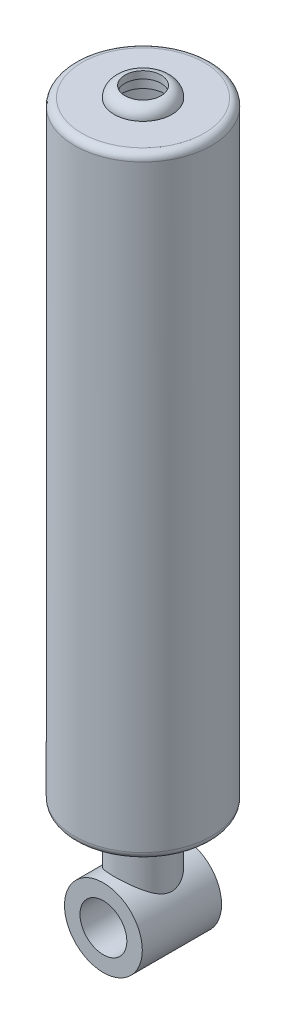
ISO-10303-21;
HEADER;
FILE_DESCRIPTION(('STEP AP214'),'2;1');
FILE_NAME('part.step','',(''),(''),'','','');
FILE_SCHEMA(('AUTOMOTIVE_DESIGN { 1 0 10303 214 1 1 1 1 }'));
ENDSEC;
DATA;
#1=APPLICATION_CONTEXT('core data for automotive mechanical design processes');
#2=APPLICATION_PROTOCOL_DEFINITION('international standard','automotive_design',2000,#1);
#3=PRODUCT_CONTEXT('',#1,'mechanical');
#4=PRODUCT('Part','Part','',(#3));
#5=PRODUCT_RELATED_PRODUCT_CATEGORY('part','',(#4));
#6=PRODUCT_DEFINITION_FORMATION('','',#4);
#7=PRODUCT_DEFINITION_CONTEXT('part definition',#1,'design');
#8=PRODUCT_DEFINITION('design','',#6,#7);
#9=PRODUCT_DEFINITION_SHAPE('','',#8);
#10=(LENGTH_UNIT() NAMED_UNIT(*) SI_UNIT(.MILLI.,.METRE.));
#11=(NAMED_UNIT(*) PLANE_ANGLE_UNIT() SI_UNIT($,.RADIAN.));
#12=(NAMED_UNIT(*) SI_UNIT($,.STERADIAN.) SOLID_ANGLE_UNIT());
#13=UNCERTAINTY_MEASURE_WITH_UNIT(LENGTH_MEASURE(1.E-05),#10,'distance_accuracy_value','');
#14=(GEOMETRIC_REPRESENTATION_CONTEXT(3) GLOBAL_UNCERTAINTY_ASSIGNED_CONTEXT((#13)) GLOBAL_UNIT_ASSIGNED_CONTEXT((#10,
#11,#12)) REPRESENTATION_CONTEXT('',''));
#15=CARTESIAN_POINT('',(0.,0.,0.));
#16=DIRECTION('',(0.,0.,1.));
#17=DIRECTION('',(1.,0.,0.));
#18=AXIS2_PLACEMENT_3D('',#15,#16,#17);
#19=CARTESIAN_POINT('',(0.,26.,5.));
#20=DIRECTION('',(0.,1.,0.));
#21=DIRECTION('',(0.,0.,1.));
#22=AXIS2_PLACEMENT_3D('',#19,#20,#21);
#23=PLANE('',#22);
#24=CARTESIAN_POINT('',(0.,26.0000000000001,11.));
#25=DIRECTION('',(0.,-1.,0.));
#26=DIRECTION('',(0.,0.,-1.));
#27=AXIS2_PLACEMENT_3D('',#24,#25,#26);
#28=CIRCLE('',#27,17.);
#29=CARTESIAN_POINT('',(0.,26.0000000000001,-6.00000000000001));
#30=VERTEX_POINT('',#29);
#31=EDGE_CURVE('E64',#30,#30,#28,.T.);
#32=ORIENTED_EDGE('',*,*,#31,.F.);
#33=EDGE_LOOP('',(#32));
#34=FACE_BOUND('',#33,.T.);
#35=CARTESIAN_POINT('',(0.,26.0000000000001,11.));
#36=DIRECTION('',(0.,1.,0.));
#37=DIRECTION('',(0.,0.,1.));
#38=AXIS2_PLACEMENT_3D('',#35,#36,#37);
#39=CIRCLE('',#38,8.);
#40=CARTESIAN_POINT('',(0.,26.0000000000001,19.));
#41=VERTEX_POINT('',#40);
#42=EDGE_CURVE('E61',#41,#41,#39,.T.);
#43=ORIENTED_EDGE('',*,*,#42,.F.);
#44=EDGE_LOOP('',(#43));
#45=FACE_BOUND('',#44,.T.);
#46=ADVANCED_FACE('F27',(#34,#45),#23,.T.);
#47=CARTESIAN_POINT('',(0.,0.,11.));
#48=DIRECTION('',(0.,-1.,0.));
#49=DIRECTION('',(0.,0.,-1.));
#50=AXIS2_PLACEMENT_3D('',#47,#48,#49);
#51=CYLINDRICAL_SURFACE('',#50,17.);
#52=ORIENTED_EDGE('',*,*,#31,.T.);
#53=EDGE_LOOP('',(#52));
#54=FACE_BOUND('',#53,.T.);
#55=CARTESIAN_POINT('',(1.76941794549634E-13,192.000000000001,11.));
#56=DIRECTION('',(0.,-1.,0.));
#57=DIRECTION('',(0.,0.,-1.));
#58=AXIS2_PLACEMENT_3D('',#55,#56,#57);
#59=CIRCLE('',#58,17.);
#60=CARTESIAN_POINT('',(1.82579981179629E-13,192.000000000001,-6.00000000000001));
#61=VERTEX_POINT('',#60);
#62=EDGE_CURVE('E177',#61,#61,#59,.T.);
#63=ORIENTED_EDGE('',*,*,#62,.F.);
#64=EDGE_LOOP('',(#63));
#65=FACE_BOUND('',#64,.T.);
#66=ADVANCED_FACE('F96',(#54,#65),#51,.F.);
#67=CARTESIAN_POINT('',(0.,192.,5.));
#68=DIRECTION('',(0.,-1.,0.));
#69=DIRECTION('',(0.,0.,-1.));
#70=AXIS2_PLACEMENT_3D('',#67,#68,#69);
#71=PLANE('',#70);
#72=ORIENTED_EDGE('',*,*,#62,.T.);
#73=EDGE_LOOP('',(#72));
#74=FACE_BOUND('',#73,.T.);
#75=CARTESIAN_POINT('',(1.76941794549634E-13,192.000000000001,11.));
#76=DIRECTION('',(0.,-1.,0.));
#77=DIRECTION('',(0.,0.,-1.));
#78=AXIS2_PLACEMENT_3D('',#75,#76,#77);
#79=CIRCLE('',#78,6.);
#80=CARTESIAN_POINT('',(1.78931742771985E-13,192.000000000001,5.));
#81=VERTEX_POINT('',#80);
#82=EDGE_CURVE('E180',#81,#81,#79,.T.);
#83=ORIENTED_EDGE('',*,*,#82,.F.);
#84=EDGE_LOOP('',(#83));
#85=FACE_BOUND('',#84,.T.);
#86=ADVANCED_FACE('F102',(#74,#85),#71,.T.);
#87=CARTESIAN_POINT('',(0.,0.,11.));
#88=DIRECTION('',(0.,-1.,0.));
#89=DIRECTION('',(0.,0.,-1.));
#90=AXIS2_PLACEMENT_3D('',#87,#88,#89);
#91=CYLINDRICAL_SURFACE('',#90,6.);
#92=ORIENTED_EDGE('',*,*,#82,.T.);
#93=EDGE_LOOP('',(#92));
#94=FACE_BOUND('',#93,.T.);
#95=CARTESIAN_POINT('',(1.87350135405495E-13,195.000000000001,11.));
#96=DIRECTION('',(0.,-1.,0.));
#97=DIRECTION('',(0.,0.,-1.));
#98=AXIS2_PLACEMENT_3D('',#95,#96,#97);
#99=CIRCLE('',#98,6.);
#100=CARTESIAN_POINT('',(1.89340083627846E-13,195.000000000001,5.));
#101=VERTEX_POINT('',#100);
#102=EDGE_CURVE('E181',#101,#101,#99,.T.);
#103=ORIENTED_EDGE('',*,*,#102,.F.);
#104=EDGE_LOOP('',(#103));
#105=FACE_BOUND('',#104,.T.);
#106=ADVANCED_FACE('F166',(#94,#105),#91,.F.);
#107=CARTESIAN_POINT('',(1.87350135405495E-13,195.000000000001,11.));
#108=DIRECTION('',(0.,-1.,0.));
#109=DIRECTION('',(0.,0.,-1.));
#110=AXIS2_PLACEMENT_3D('',#107,#108,#109);
#111=PLANE('',#110);
#112=CARTESIAN_POINT('',(1.87350135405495E-13,195.000000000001,11.));
#113=DIRECTION('',(0.,-1.,0.));
#114=DIRECTION('',(0.,0.,-1.));
#115=AXIS2_PLACEMENT_3D('',#112,#113,#114);
#116=CIRCLE('',#115,5.);
#117=CARTESIAN_POINT('',(1.89008425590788E-13,195.000000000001,5.99999999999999));
#118=VERTEX_POINT('',#117);
#119=EDGE_CURVE('E52',#118,#118,#116,.T.);
#120=ORIENTED_EDGE('',*,*,#119,.F.);
#121=EDGE_LOOP('',(#120));
#122=FACE_BOUND('',#121,.T.);
#123=ORIENTED_EDGE('',*,*,#102,.T.);
#124=EDGE_LOOP('',(#123));
#125=FACE_BOUND('',#124,.T.);
#126=ADVANCED_FACE('F163',(#122,#125),#111,.T.);
#127=CARTESIAN_POINT('',(0.,30.0000000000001,10.9999999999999));
#128=DIRECTION('',(0.,1.,0.));
#129=DIRECTION('',(0.,0.,1.));
#130=AXIS2_PLACEMENT_3D('',#127,#128,#129);
#131=PLANE('',#130);
#132=CARTESIAN_POINT('',(0.,30.0000000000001,10.9999999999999));
#133=DIRECTION('',(0.,1.,0.));
#134=DIRECTION('',(0.,0.,1.));
#135=AXIS2_PLACEMENT_3D('',#132,#133,#134);
#136=CIRCLE('',#135,5.);
#137=CARTESIAN_POINT('',(0.,30.0000000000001,15.9999999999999));
#138=VERTEX_POINT('',#137);
#139=EDGE_CURVE('E196',#138,#138,#136,.T.);
#140=ORIENTED_EDGE('',*,*,#139,.F.);
#141=EDGE_LOOP('',(#140));
#142=FACE_BOUND('',#141,.T.);
#143=CARTESIAN_POINT('',(0.,30.0000000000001,10.9999999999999));
#144=DIRECTION('',(0.,1.,0.));
#145=DIRECTION('',(0.,0.,1.));
#146=AXIS2_PLACEMENT_3D('',#143,#144,#145);
#147=CIRCLE('',#146,8.);
#148=CARTESIAN_POINT('',(0.,30.0000000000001,18.9999999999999));
#149=VERTEX_POINT('',#148);
#150=EDGE_CURVE('E123',#149,#149,#147,.T.);
#151=ORIENTED_EDGE('',*,*,#150,.T.);
#152=EDGE_LOOP('',(#151));
#153=FACE_BOUND('',#152,.T.);
#154=ADVANCED_FACE('F78',(#142,#153),#131,.T.);
#155=CARTESIAN_POINT('',(0.,30.0000000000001,10.9999999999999));
#156=DIRECTION('',(0.,-1.,0.));
#157=DIRECTION('',(0.,0.,-1.));
#158=AXIS2_PLACEMENT_3D('',#155,#156,#157);
#159=CYLINDRICAL_SURFACE('',#158,8.);
#160=ORIENTED_EDGE('',*,*,#42,.T.);
#161=EDGE_LOOP('',(#160));
#162=FACE_BOUND('',#161,.T.);
#163=ORIENTED_EDGE('',*,*,#150,.F.);
#164=EDGE_LOOP('',(#163));
#165=FACE_BOUND('',#164,.T.);
#166=ADVANCED_FACE('F72',(#162,#165),#159,.T.);
#167=CARTESIAN_POINT('',(1.6826817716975E-13,167.,11.));
#168=DIRECTION('',(0.,1.,0.));
#169=DIRECTION('',(0.,0.,1.));
#170=AXIS2_PLACEMENT_3D('',#167,#168,#169);
#171=CYLINDRICAL_SURFACE('',#170,5.);
#172=ORIENTED_EDGE('',*,*,#119,.T.);
#173=EDGE_LOOP('',(#172));
#174=FACE_BOUND('',#173,.T.);
#175=CARTESIAN_POINT('',(1.31838984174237E-13,197.000000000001,10.9999999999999));
#176=DIRECTION('',(0.,1.,0.));
#177=DIRECTION('',(0.,0.,1.));
#178=AXIS2_PLACEMENT_3D('',#175,#176,#177);
#179=CIRCLE('',#178,5.);
#180=CARTESIAN_POINT('',(1.30180693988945E-13,197.000000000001,15.9999999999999));
#181=VERTEX_POINT('',#180);
#182=EDGE_CURVE('E56',#181,#181,#179,.T.);
#183=ORIENTED_EDGE('',*,*,#182,.T.);
#184=EDGE_LOOP('',(#183));
#185=FACE_BOUND('',#184,.T.);
#186=ADVANCED_FACE('F77',(#174,#185),#171,.F.);
#187=CARTESIAN_POINT('',(0.,21.0000000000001,11.));
#188=DIRECTION('',(0.,-1.,0.));
#189=DIRECTION('',(0.,0.,-1.));
#190=AXIS2_PLACEMENT_3D('',#187,#188,#189);
#191=CIRCLE('',#190,8.);
#192=CARTESIAN_POINT('',(0.,21.0000000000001,3.00000000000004));
#193=VERTEX_POINT('',#192);
#194=EDGE_CURVE('E57',#193,#193,#191,.T.);
#195=ORIENTED_EDGE('',*,*,#194,.T.);
#196=EDGE_LOOP('',(#195));
#197=FACE_BOUND('',#196,.T.);
#198=CARTESIAN_POINT('',(0.,10.8,2.99999999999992));
#199=CARTESIAN_POINT('',(-0.196279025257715,10.8000009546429,2.99999899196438));
#200=CARTESIAN_POINT('',(-0.392546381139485,10.794638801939,3.00723327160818));
#201=CARTESIAN_POINT('',(-0.783431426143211,10.7733253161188,3.03604161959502));
#202=CARTESIAN_POINT('',(-0.978049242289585,10.7573748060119,3.05761457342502));
#203=CARTESIAN_POINT('',(-1.36414109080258,10.715262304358,3.11474680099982));
#204=CARTESIAN_POINT('',(-1.55561427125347,10.6890975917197,3.15030980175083));
#205=CARTESIAN_POINT('',(-1.93397723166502,10.6271579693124,3.23486547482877));
#206=CARTESIAN_POINT('',(-2.12086685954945,10.5913827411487,3.28385859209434));
#207=CARTESIAN_POINT('',(-2.48786322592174,10.5112144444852,3.39427441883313));
#208=CARTESIAN_POINT('',(-2.66800135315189,10.4668693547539,3.45562800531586));
#209=CARTESIAN_POINT('',(-3.02167978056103,10.3702976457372,3.5901910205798));
#210=CARTESIAN_POINT('',(-3.19521744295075,10.3180679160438,3.66340512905));
#211=CARTESIAN_POINT('',(-3.53481579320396,10.2067135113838,3.82085676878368));
#212=CARTESIAN_POINT('',(-3.70087928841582,10.1475914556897,3.90509011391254));
#213=CARTESIAN_POINT('',(-4.0251062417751,10.0234062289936,4.08387325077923));
#214=CARTESIAN_POINT('',(-4.1832667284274,9.95834084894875,4.17842688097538));
#215=CARTESIAN_POINT('',(-4.50532077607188,9.8171157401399,4.38621944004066));
#216=CARTESIAN_POINT('',(-4.6684153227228,9.7404856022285,4.50037641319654));
#217=CARTESIAN_POINT('',(-4.98429836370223,9.58269008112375,4.73932897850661));
#218=CARTESIAN_POINT('',(-5.13708554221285,9.50152412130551,4.86412592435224));
#219=CARTESIAN_POINT('',(-5.43230730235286,9.33588374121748,5.12388277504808));
#220=CARTESIAN_POINT('',(-5.57472613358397,9.25140457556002,5.2588575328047));
#221=CARTESIAN_POINT('',(-5.84871747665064,9.080669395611,5.53824390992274));
#222=CARTESIAN_POINT('',(-5.9802929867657,8.99441388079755,5.68265290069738));
#223=CARTESIAN_POINT('',(-6.25750885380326,8.80438161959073,6.01017916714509));
#224=CARTESIAN_POINT('',(-6.4007528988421,8.70052724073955,6.1952881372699));
#225=CARTESIAN_POINT('',(-6.67105068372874,8.49505216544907,6.5782308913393));
#226=CARTESIAN_POINT('',(-6.79809965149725,8.39343213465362,6.7760684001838));
#227=CARTESIAN_POINT('',(-7.03519833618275,8.19571693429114,7.1840393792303));
#228=CARTESIAN_POINT('',(-7.14526592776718,8.09961602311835,7.39415959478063));
#229=CARTESIAN_POINT('',(-7.34750160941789,7.91661602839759,7.82648283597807));
#230=CARTESIAN_POINT('',(-7.43967980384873,7.82971176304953,8.04867894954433));
#231=CARTESIAN_POINT('',(-7.63159301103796,7.64343078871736,8.5789146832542));
#232=CARTESIAN_POINT('',(-7.72415166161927,7.54909241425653,8.8914998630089));
#233=CARTESIAN_POINT('',(-7.83448398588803,7.4339545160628,9.37274146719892));
#234=CARTESIAN_POINT('',(-7.86650046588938,7.39998188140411,9.53512107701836));
#235=CARTESIAN_POINT('',(-7.92057039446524,7.3420801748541,9.86326525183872));
#236=CARTESIAN_POINT('',(-7.94262890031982,7.31814600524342,10.0290280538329));
#237=CARTESIAN_POINT('',(-7.97649745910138,7.28121754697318,10.3642927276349));
#238=CARTESIAN_POINT('',(-7.98821672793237,7.26832019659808,10.5338145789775));
#239=CARTESIAN_POINT('',(-8.0008113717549,7.25445434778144,10.8737494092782));
#240=CARTESIAN_POINT('',(-8.00168722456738,7.25348532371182,11.0441623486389));
#241=CARTESIAN_POINT('',(-7.99257147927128,7.26352843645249,11.3844266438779));
#242=CARTESIAN_POINT('',(-7.98257420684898,7.2745468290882,11.5542776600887));
#243=CARTESIAN_POINT('',(-7.95193692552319,7.30802341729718,11.891874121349));
#244=CARTESIAN_POINT('',(-7.93129575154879,7.33048286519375,12.05961933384));
#245=CARTESIAN_POINT('',(-7.87723784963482,7.38856190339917,12.4082834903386));
#246=CARTESIAN_POINT('',(-7.84275537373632,7.42526750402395,12.5888549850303));
#247=CARTESIAN_POINT('',(-7.7621391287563,7.50949957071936,12.9448778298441));
#248=CARTESIAN_POINT('',(-7.71599758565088,7.55703325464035,13.1203256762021));
#249=CARTESIAN_POINT('',(-7.61271497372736,7.66106686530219,13.4655844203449));
#250=CARTESIAN_POINT('',(-7.55555288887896,7.71758388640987,13.6353838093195));
#251=CARTESIAN_POINT('',(-7.43097899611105,7.83760373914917,13.9685310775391));
#252=CARTESIAN_POINT('',(-7.36356988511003,7.90110473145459,14.1318806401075));
#253=CARTESIAN_POINT('',(-7.19258768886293,8.05757775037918,14.5105896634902));
#254=CARTESIAN_POINT('',(-7.08480640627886,8.15283246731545,14.723113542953));
#255=CARTESIAN_POINT('',(-6.85215960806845,8.34931825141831,15.1357017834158));
#256=CARTESIAN_POINT('',(-6.72728825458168,8.4505513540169,15.3357618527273));
#257=CARTESIAN_POINT('',(-6.46103924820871,8.6558222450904,15.7233781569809));
#258=CARTESIAN_POINT('',(-6.31964553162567,8.75986268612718,15.9109219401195));
#259=CARTESIAN_POINT('',(-6.02092998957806,8.96780483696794,16.2728983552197));
#260=CARTESIAN_POINT('',(-5.86361006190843,9.07170656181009,16.4473325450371));
#261=CARTESIAN_POINT('',(-5.53068847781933,9.27849700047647,16.7852083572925));
#262=CARTESIAN_POINT('',(-5.354831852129,9.38134200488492,16.9484260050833));
#263=CARTESIAN_POINT('',(-4.98734856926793,9.58176175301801,17.2597394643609));
#264=CARTESIAN_POINT('',(-4.79572018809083,9.67933591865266,17.4078336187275));
#265=CARTESIAN_POINT('',(-4.39761924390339,9.86657184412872,17.6872994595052));
#266=CARTESIAN_POINT('',(-4.19117612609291,9.95624855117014,17.8187029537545));
#267=CARTESIAN_POINT('',(-3.76397643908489,10.125473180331,18.0634995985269));
#268=CARTESIAN_POINT('',(-3.54322523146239,10.2050248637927,18.1768994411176));
#269=CARTESIAN_POINT('',(-3.14668728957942,10.3329584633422,18.3575119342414));
#270=CARTESIAN_POINT('',(-2.973788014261,10.3841159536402,18.4291286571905));
#271=CARTESIAN_POINT('',(-2.62151761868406,10.4785913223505,18.560619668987));
#272=CARTESIAN_POINT('',(-2.44214795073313,10.5219109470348,18.6204965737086));
#273=CARTESIAN_POINT('',(-2.07795643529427,10.5998469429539,18.7277494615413));
#274=CARTESIAN_POINT('',(-1.89313744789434,10.6344677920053,18.77513187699));
#275=CARTESIAN_POINT('',(-1.51911019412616,10.6943054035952,18.8567767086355));
#276=CARTESIAN_POINT('',(-1.32990182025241,10.719521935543,18.8910388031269));
#277=CARTESIAN_POINT('',(-0.947638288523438,10.7600686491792,18.9460320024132));
#278=CARTESIAN_POINT('',(-0.754570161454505,10.7753561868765,18.9667047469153));
#279=CARTESIAN_POINT('',(-0.366895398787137,10.7955110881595,18.9939442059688));
#280=CARTESIAN_POINT('',(-0.17228876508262,10.8003784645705,19.0005109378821));
#281=CARTESIAN_POINT('',(0.21685808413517,10.7995755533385,18.9994269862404));
#282=CARTESIAN_POINT('',(0.411398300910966,10.7939054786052,18.9917765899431));
#283=CARTESIAN_POINT('',(0.79881691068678,10.7721646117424,18.9623883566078));
#284=CARTESIAN_POINT('',(0.991695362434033,10.7560941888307,18.9406510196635));
#285=CARTESIAN_POINT('',(1.36157595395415,10.7153350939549,18.8853490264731));
#286=CARTESIAN_POINT('',(1.53878223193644,10.6912891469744,18.8526650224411));
#287=CARTESIAN_POINT('',(1.88939034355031,10.6349302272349,18.7757588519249));
#288=CARTESIAN_POINT('',(2.06279086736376,10.6026144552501,18.7315327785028));
#289=CARTESIAN_POINT('',(2.40472053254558,10.5303300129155,18.6321042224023));
#290=CARTESIAN_POINT('',(2.57325087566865,10.4903632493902,18.5769044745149));
#291=CARTESIAN_POINT('',(2.90474789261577,10.4034523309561,18.4561101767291));
#292=CARTESIAN_POINT('',(3.06771248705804,10.3565056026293,18.390511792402));
#293=CARTESIAN_POINT('',(3.39922868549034,10.2526870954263,18.2443383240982));
#294=CARTESIAN_POINT('',(3.56730081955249,10.1953378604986,18.1630140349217));
#295=CARTESIAN_POINT('',(3.89565891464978,10.0744483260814,17.98987372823));
#296=CARTESIAN_POINT('',(4.05594161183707,10.0109054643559,17.8980533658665));
#297=CARTESIAN_POINT('',(4.52445302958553,9.81244800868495,17.6078881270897));
#298=CARTESIAN_POINT('',(4.82046077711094,9.66966720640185,17.3947874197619));
#299=CARTESIAN_POINT('',(5.26331424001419,9.43252746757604,17.0285391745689));
#300=CARTESIAN_POINT('',(5.4217480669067,9.34217685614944,16.8863986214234));
#301=CARTESIAN_POINT('',(5.7260550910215,9.15880919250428,16.5908172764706));
#302=CARTESIAN_POINT('',(5.8719302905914,9.0657925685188,16.4373782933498));
#303=CARTESIAN_POINT('',(6.15100545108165,8.87881710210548,16.1195633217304));
#304=CARTESIAN_POINT('',(6.28419038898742,8.78485728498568,15.9551747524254));
#305=CARTESIAN_POINT('',(6.53740799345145,8.59808305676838,15.61595971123));
#306=CARTESIAN_POINT('',(6.65744194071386,8.5052685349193,15.4411342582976));
#307=CARTESIAN_POINT('',(6.87546293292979,8.32983180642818,15.094715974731));
#308=CARTESIAN_POINT('',(6.97442787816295,8.24696686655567,14.9238616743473));
#309=CARTESIAN_POINT('',(7.16029008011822,8.08612066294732,14.5734543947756));
#310=CARTESIAN_POINT('',(7.24718646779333,8.00813975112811,14.3939007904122));
#311=CARTESIAN_POINT('',(7.40811233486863,7.85950711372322,14.0265522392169));
#312=CARTESIAN_POINT('',(7.4821621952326,7.78884385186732,13.8387709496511));
#313=CARTESIAN_POINT('',(7.61667881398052,7.65735309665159,13.4550934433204));
#314=CARTESIAN_POINT('',(7.67715161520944,7.59652123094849,13.2592008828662));
#315=CARTESIAN_POINT('',(7.77029884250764,7.5010490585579,12.9095996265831));
#316=CARTESIAN_POINT('',(7.8061476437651,7.46365519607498,12.7574850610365));
#317=CARTESIAN_POINT('',(7.86911238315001,7.39724057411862,12.4497291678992));
#318=CARTESIAN_POINT('',(7.89623351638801,7.36821483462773,12.294089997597));
#319=CARTESIAN_POINT('',(7.94130243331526,7.31961873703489,11.9802132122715));
#320=CARTESIAN_POINT('',(7.95926146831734,7.30003678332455,11.821979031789));
#321=CARTESIAN_POINT('',(7.98571776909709,7.27108661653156,11.5037800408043));
#322=CARTESIAN_POINT('',(7.99421505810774,7.26171837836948,11.3438152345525));
#323=CARTESIAN_POINT('',(8.00158265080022,7.25359958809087,11.0228670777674));
#324=CARTESIAN_POINT('',(8.00042141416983,7.25488382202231,10.8618821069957));
#325=CARTESIAN_POINT('',(7.98842208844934,7.26809395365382,10.5407206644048));
#326=CARTESIAN_POINT('',(7.97758408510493,7.28001975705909,10.3805441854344));
#327=CARTESIAN_POINT('',(7.94643942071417,7.31400214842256,10.0620620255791));
#328=CARTESIAN_POINT('',(7.92612397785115,7.33606813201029,9.90375821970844));
#329=CARTESIAN_POINT('',(7.87638382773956,7.38944534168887,9.59009990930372));
#330=CARTESIAN_POINT('',(7.84695365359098,7.42076211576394,9.43474723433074));
#331=CARTESIAN_POINT('',(7.77054501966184,7.50082964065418,9.08740226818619));
#332=CARTESIAN_POINT('',(7.72098636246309,7.55199967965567,8.89653368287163));
#333=CARTESIAN_POINT('',(7.60899092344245,7.66482641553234,8.52178579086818));
#334=CARTESIAN_POINT('',(7.54654858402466,7.72648763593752,8.33790954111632));
#335=CARTESIAN_POINT('',(7.40951161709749,7.85800026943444,7.97735093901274));
#336=CARTESIAN_POINT('',(7.33489343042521,7.92786748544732,7.80068338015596));
#337=CARTESIAN_POINT('',(7.17428651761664,8.07349799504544,7.45515638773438));
#338=CARTESIAN_POINT('',(7.08829733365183,8.14926152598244,7.28629726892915));
#339=CARTESIAN_POINT('',(6.87798699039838,8.32812269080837,6.90690326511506));
#340=CARTESIAN_POINT('',(6.7499111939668,8.4325937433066,6.69908959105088));
#341=CARTESIAN_POINT('',(6.47618672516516,8.64459378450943,6.29700382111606));
#342=CARTESIAN_POINT('',(6.33053345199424,8.75212356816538,6.10273529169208));
#343=CARTESIAN_POINT('',(6.02209663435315,8.96714644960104,5.72806956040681));
#344=CARTESIAN_POINT('',(5.85930401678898,9.07463949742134,5.54767979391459));
#345=CARTESIAN_POINT('',(5.51704883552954,9.28669476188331,5.20160486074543));
#346=CARTESIAN_POINT('',(5.33758790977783,9.39125726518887,5.03591825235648));
#347=CARTESIAN_POINT('',(4.96159639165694,9.59523276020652,4.71962162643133));
#348=CARTESIAN_POINT('',(4.76499864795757,9.69462281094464,4.5690764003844));
#349=CARTESIAN_POINT('',(4.35591389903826,9.88518705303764,4.28524163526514));
#350=CARTESIAN_POINT('',(4.14342568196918,9.97636061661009,4.15195341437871));
#351=CARTESIAN_POINT('',(3.70390052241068,10.147741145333,3.90460828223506));
#352=CARTESIAN_POINT('',(3.47689181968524,10.2279685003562,3.79051551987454));
#353=CARTESIAN_POINT('',(3.00942760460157,10.375129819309,3.58321836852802));
#354=CARTESIAN_POINT('',(2.76897671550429,10.4420683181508,3.49000685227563));
#355=CARTESIAN_POINT('',(2.32308709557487,10.5491951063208,3.34182719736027));
#356=CARTESIAN_POINT('',(2.1195760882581,10.5920468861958,3.28296311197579));
#357=CARTESIAN_POINT('',(1.70657705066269,10.6663762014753,3.1812539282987));
#358=CARTESIAN_POINT('',(1.49709049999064,10.6978565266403,3.13840490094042));
#359=CARTESIAN_POINT('',(1.07408292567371,10.74856665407,3.06953800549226));
#360=CARTESIAN_POINT('',(0.860565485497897,10.7678068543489,3.04350585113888));
#361=CARTESIAN_POINT('',(0.431360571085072,10.7935225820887,3.00873797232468));
#362=CARTESIAN_POINT('',(0.215673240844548,10.7999989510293,3.00000110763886));
#363=CARTESIAN_POINT('',(0.,10.8,2.99999999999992));
#364=B_SPLINE_CURVE_WITH_KNOTS('',3,(#198,#199,#200,#201,#202,#203,#204,#205,#206,#207,#208,
#209,#210,#211,#212,#213,#214,#215,#216,#217,#218,#219,#220,#221,#222,#223,#224,#225,#226,#227,
#228,#229,#230,#231,#232,#233,#234,#235,#236,#237,#238,#239,#240,#241,#242,#243,#244,#245,#246,
#247,#248,#249,#250,#251,#252,#253,#254,#255,#256,#257,#258,#259,#260,#261,#262,#263,#264,#265,
#266,#267,#268,#269,#270,#271,#272,#273,#274,#275,#276,#277,#278,#279,#280,#281,#282,#283,#284,
#285,#286,#287,#288,#289,#290,#291,#292,#293,#294,#295,#296,#297,#298,#299,#300,#301,#302,#303,
#304,#305,#306,#307,#308,#309,#310,#311,#312,#313,#314,#315,#316,#317,#318,#319,#320,#321,#322,
#323,#324,#325,#326,#327,#328,#329,#330,#331,#332,#333,#334,#335,#336,#337,#338,#339,#340,#341,
#342,#343,#344,#345,#346,#347,#348,#349,#350,#351,#352,#353,#354,#355,#356,#357,#358,#359,#360,
#361,#362,#363),.UNSPECIFIED.,.T.,.F.,(4,2,2,2,2,2,2,2,2,2,2,2,2,2,2,2,2,2,2,2,2,2,2,2,2,2,2,2,
2,2,2,2,2,2,2,2,2,2,2,2,2,2,2,2,2,2,2,2,2,2,2,2,2,2,2,2,2,2,2,2,2,2,2,2,2,2,2,2,2,2,2,2,2,2,2,2,
2,2,2,2,2,2,4),(0.,0.588612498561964,1.17717925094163,1.76590290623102,2.35464606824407,
2.94018391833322,3.52595336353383,4.11150092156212,4.69726701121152,5.33661634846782,
5.97604714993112,6.61642986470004,7.25663490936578,8.02398458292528,8.79155984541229,
9.55832156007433,10.3246489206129,11.3385052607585,11.8448635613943,12.3509644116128,
12.8614660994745,13.3719452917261,13.8826910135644,14.3934926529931,14.9550562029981,
15.516995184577,16.0800165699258,16.6428900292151,17.4116880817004,18.1807494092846,
18.9505647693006,19.7202885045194,20.5024871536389,21.2847714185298,22.0655417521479,
22.8460211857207,23.4274893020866,24.0088277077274,24.589866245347,25.1709190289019,
25.7544511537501,26.3379825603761,26.9215021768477,27.505001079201,28.0497763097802,
28.5947361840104,29.1395604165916,29.6845860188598,30.2699586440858,30.8555744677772,
32.0264133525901,32.7196087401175,33.4126933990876,34.1065886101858,34.8004161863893,
35.4422796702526,36.0841893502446,36.7250711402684,37.3656671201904,37.8473073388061,
38.3286603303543,38.8094207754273,39.2901800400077,39.7725098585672,40.2548354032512,
40.7376087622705,41.2206722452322,41.8309348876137,42.4414613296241,43.0531834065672,
43.6649301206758,44.4604735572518,45.2562256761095,46.0524011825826,46.8484985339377,
47.6478691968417,48.4473008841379,49.2452224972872,50.0428713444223,50.690396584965,
51.3377628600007,51.9845784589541,52.6313514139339),.UNSPECIFIED.);
#365=CARTESIAN_POINT('',(0.,10.8,2.99999999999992));
#366=VERTEX_POINT('',#365);
#367=EDGE_CURVE('E51',#366,#366,#364,.T.);
#368=ORIENTED_EDGE('',*,*,#367,.T.);
#369=EDGE_LOOP('',(#368));
#370=FACE_BOUND('',#369,.T.);
#371=ADVANCED_FACE('F80',(#197,#370),#159,.T.);
#372=CARTESIAN_POINT('',(0.,0.,22.));
#373=DIRECTION('',(0.,0.,-1.));
#374=DIRECTION('',(-1.,0.,0.));
#375=AXIS2_PLACEMENT_3D('',#372,#373,#374);
#376=CYLINDRICAL_SURFACE('',#375,10.8);
#377=CARTESIAN_POINT('',(0.,0.,0.));
#378=DIRECTION('',(0.,0.,1.));
#379=DIRECTION('',(1.,0.,0.));
#380=AXIS2_PLACEMENT_3D('',#377,#378,#379);
#381=CIRCLE('',#380,10.8);
#382=CARTESIAN_POINT('',(10.8,0.,0.));
#383=VERTEX_POINT('',#382);
#384=EDGE_CURVE('E129',#383,#383,#381,.T.);
#385=ORIENTED_EDGE('',*,*,#384,.T.);
#386=EDGE_LOOP('',(#385));
#387=FACE_BOUND('',#386,.T.);
#388=CARTESIAN_POINT('',(0.,0.,22.));
#389=DIRECTION('',(0.,0.,1.));
#390=DIRECTION('',(1.,0.,0.));
#391=AXIS2_PLACEMENT_3D('',#388,#389,#390);
#392=CIRCLE('',#391,10.8);
#393=CARTESIAN_POINT('',(10.8,0.,22.));
#394=VERTEX_POINT('',#393);
#395=EDGE_CURVE('E70',#394,#394,#392,.T.);
#396=ORIENTED_EDGE('',*,*,#395,.F.);
#397=EDGE_LOOP('',(#396));
#398=FACE_BOUND('',#397,.T.);
#399=ORIENTED_EDGE('',*,*,#367,.F.);
#400=EDGE_LOOP('',(#399));
#401=FACE_BOUND('',#400,.T.);
#402=ADVANCED_FACE('F29',(#387,#398,#401),#376,.T.);
#403=CARTESIAN_POINT('',(0.,0.,22.));
#404=DIRECTION('',(0.,0.,1.));
#405=DIRECTION('',(1.,0.,0.));
#406=AXIS2_PLACEMENT_3D('',#403,#404,#405);
#407=PLANE('',#406);
#408=CARTESIAN_POINT('',(0.,0.,22.));
#409=DIRECTION('',(0.,0.,-1.));
#410=DIRECTION('',(-1.,0.,0.));
#411=AXIS2_PLACEMENT_3D('',#408,#409,#410);
#412=CIRCLE('',#411,6.5);
#413=CARTESIAN_POINT('',(-6.50000000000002,0.,22.));
#414=VERTEX_POINT('',#413);
#415=EDGE_CURVE('E119',#414,#414,#412,.T.);
#416=ORIENTED_EDGE('',*,*,#415,.T.);
#417=EDGE_LOOP('',(#416));
#418=FACE_BOUND('',#417,.T.);
#419=ORIENTED_EDGE('',*,*,#395,.T.);
#420=EDGE_LOOP('',(#419));
#421=FACE_BOUND('',#420,.T.);
#422=ADVANCED_FACE('F85',(#418,#421),#407,.T.);
#423=CARTESIAN_POINT('',(0.,0.,0.));
#424=DIRECTION('',(0.,0.,1.));
#425=DIRECTION('',(1.,0.,0.));
#426=AXIS2_PLACEMENT_3D('',#423,#424,#425);
#427=PLANE('',#426);
#428=CARTESIAN_POINT('',(0.,0.,0.));
#429=DIRECTION('',(0.,0.,-1.));
#430=DIRECTION('',(-1.,0.,0.));
#431=AXIS2_PLACEMENT_3D('',#428,#429,#430);
#432=CIRCLE('',#431,6.5);
#433=CARTESIAN_POINT('',(-6.50000000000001,0.,0.));
#434=VERTEX_POINT('',#433);
#435=EDGE_CURVE('E60',#434,#434,#432,.T.);
#436=ORIENTED_EDGE('',*,*,#435,.F.);
#437=EDGE_LOOP('',(#436));
#438=FACE_BOUND('',#437,.T.);
#439=ORIENTED_EDGE('',*,*,#384,.F.);
#440=EDGE_LOOP('',(#439));
#441=FACE_BOUND('',#440,.T.);
#442=ADVANCED_FACE('F82',(#438,#441),#427,.F.);
#443=CARTESIAN_POINT('',(0.,0.,22.));
#444=DIRECTION('',(0.,0.,-1.));
#445=DIRECTION('',(-1.,0.,0.));
#446=AXIS2_PLACEMENT_3D('',#443,#444,#445);
#447=CYLINDRICAL_SURFACE('',#446,6.5);
#448=ORIENTED_EDGE('',*,*,#415,.F.);
#449=EDGE_LOOP('',(#448));
#450=FACE_BOUND('',#449,.T.);
#451=ORIENTED_EDGE('',*,*,#435,.T.);
#452=EDGE_LOOP('',(#451));
#453=FACE_BOUND('',#452,.T.);
#454=ADVANCED_FACE('F84',(#450,#453),#447,.F.);
#455=CARTESIAN_POINT('',(0.,21.0000000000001,11.));
#456=DIRECTION('',(0.,-1.,0.));
#457=DIRECTION('',(0.,0.,-1.));
#458=AXIS2_PLACEMENT_3D('',#455,#456,#457);
#459=PLANE('',#458);
#460=CARTESIAN_POINT('',(0.,21.0000000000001,11.));
#461=DIRECTION('',(0.,-1.,0.));
#462=DIRECTION('',(0.,0.,-1.));
#463=AXIS2_PLACEMENT_3D('',#460,#461,#462);
#464=CIRCLE('',#463,10.);
#465=CARTESIAN_POINT('',(0.,21.0000000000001,1.00000000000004));
#466=VERTEX_POINT('',#465);
#467=EDGE_CURVE('E39',#466,#466,#464,.T.);
#468=ORIENTED_EDGE('',*,*,#467,.T.);
#469=EDGE_LOOP('',(#468));
#470=FACE_BOUND('',#469,.T.);
#471=ORIENTED_EDGE('',*,*,#194,.F.);
#472=EDGE_LOOP('',(#471));
#473=FACE_BOUND('',#472,.T.);
#474=ADVANCED_FACE('F109',(#470,#473),#459,.T.);
#475=CARTESIAN_POINT('',(0.,194.,2.99999999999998));
#476=DIRECTION('',(0.,1.,0.));
#477=DIRECTION('',(0.,0.,1.));
#478=AXIS2_PLACEMENT_3D('',#475,#476,#477);
#479=PLANE('',#478);
#480=CARTESIAN_POINT('',(1.83880688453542E-13,194.000000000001,11.));
#481=DIRECTION('',(0.,1.,0.));
#482=DIRECTION('',(0.,0.,1.));
#483=AXIS2_PLACEMENT_3D('',#480,#481,#482);
#484=CIRCLE('',#483,17.);
#485=CARTESIAN_POINT('',(1.78242501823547E-13,194.000000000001,28.));
#486=VERTEX_POINT('',#485);
#487=EDGE_CURVE('E10',#486,#486,#484,.T.);
#488=ORIENTED_EDGE('',*,*,#487,.T.);
#489=EDGE_LOOP('',(#488));
#490=FACE_BOUND('',#489,.T.);
#491=CARTESIAN_POINT('',(1.83880688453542E-13,194.000000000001,11.));
#492=DIRECTION('',(0.,-1.,0.));
#493=DIRECTION('',(0.,0.,-1.));
#494=AXIS2_PLACEMENT_3D('',#491,#492,#493);
#495=CIRCLE('',#494,8.);
#496=CARTESIAN_POINT('',(1.8653395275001E-13,194.000000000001,3.00000000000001));
#497=VERTEX_POINT('',#496);
#498=EDGE_CURVE('E184',#497,#497,#495,.T.);
#499=ORIENTED_EDGE('',*,*,#498,.T.);
#500=EDGE_LOOP('',(#499));
#501=FACE_BOUND('',#500,.T.);
#502=ADVANCED_FACE('F114',(#490,#501),#479,.T.);
#503=CARTESIAN_POINT('',(0.,0.,11.));
#504=DIRECTION('',(0.,-1.,0.));
#505=DIRECTION('',(0.,0.,-1.));
#506=AXIS2_PLACEMENT_3D('',#503,#504,#505);
#507=CYLINDRICAL_SURFACE('',#506,19.);
#508=CARTESIAN_POINT('',(1.76941794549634E-13,192.000000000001,11.));
#509=DIRECTION('',(0.,1.,0.));
#510=DIRECTION('',(0.,0.,1.));
#511=AXIS2_PLACEMENT_3D('',#508,#509,#510);
#512=CIRCLE('',#511,19.);
#513=CARTESIAN_POINT('',(1.70640291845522E-13,192.000000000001,30.));
#514=VERTEX_POINT('',#513);
#515=EDGE_CURVE('E35',#514,#514,#512,.F.);
#516=ORIENTED_EDGE('',*,*,#515,.T.);
#517=EDGE_LOOP('',(#516));
#518=FACE_BOUND('',#517,.T.);
#519=CARTESIAN_POINT('',(0.,26.0000000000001,11.));
#520=DIRECTION('',(0.,-1.,0.));
#521=DIRECTION('',(0.,0.,-1.));
#522=AXIS2_PLACEMENT_3D('',#519,#520,#521);
#523=CIRCLE('',#522,19.);
#524=CARTESIAN_POINT('',(0.,26.0000000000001,-8.));
#525=VERTEX_POINT('',#524);
#526=EDGE_CURVE('E43',#525,#525,#523,.F.);
#527=ORIENTED_EDGE('',*,*,#526,.T.);
#528=EDGE_LOOP('',(#527));
#529=FACE_BOUND('',#528,.T.);
#530=ADVANCED_FACE('F157',(#518,#529),#507,.T.);
#531=CARTESIAN_POINT('',(0.,24.,-2.));
#532=DIRECTION('',(0.,-1.,0.));
#533=DIRECTION('',(0.,0.,-1.));
#534=AXIS2_PLACEMENT_3D('',#531,#532,#533);
#535=PLANE('',#534);
#536=CARTESIAN_POINT('',(0.,24.0000000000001,11.));
#537=DIRECTION('',(0.,-1.,0.));
#538=DIRECTION('',(0.,0.,-1.));
#539=AXIS2_PLACEMENT_3D('',#536,#537,#538);
#540=CIRCLE('',#539,17.);
#541=CARTESIAN_POINT('',(0.,24.0000000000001,-6.));
#542=VERTEX_POINT('',#541);
#543=EDGE_CURVE('E48',#542,#542,#540,.T.);
#544=ORIENTED_EDGE('',*,*,#543,.T.);
#545=EDGE_LOOP('',(#544));
#546=FACE_BOUND('',#545,.T.);
#547=CARTESIAN_POINT('',(0.,24.0000000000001,11.));
#548=DIRECTION('',(0.,-1.,0.));
#549=DIRECTION('',(0.,0.,-1.));
#550=AXIS2_PLACEMENT_3D('',#547,#548,#549);
#551=CIRCLE('',#550,13.);
#552=CARTESIAN_POINT('',(0.,24.0000000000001,-2.00000000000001));
#553=VERTEX_POINT('',#552);
#554=EDGE_CURVE('E55',#553,#553,#551,.T.);
#555=ORIENTED_EDGE('',*,*,#554,.F.);
#556=EDGE_LOOP('',(#555));
#557=FACE_BOUND('',#556,.T.);
#558=ADVANCED_FACE('F154',(#546,#557),#535,.T.);
#559=CARTESIAN_POINT('',(0.,26.0000000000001,11.));
#560=DIRECTION('',(0.,-1.,0.));
#561=DIRECTION('',(0.,0.,-1.));
#562=AXIS2_PLACEMENT_3D('',#559,#560,#561);
#563=TOROIDAL_SURFACE('',#562,17.,2.);
#564=ORIENTED_EDGE('',*,*,#526,.F.);
#565=EDGE_LOOP('',(#564));
#566=FACE_BOUND('',#565,.T.);
#567=ORIENTED_EDGE('',*,*,#543,.F.);
#568=EDGE_LOOP('',(#567));
#569=FACE_BOUND('',#568,.T.);
#570=ADVANCED_FACE('F151',(#566,#569),#563,.T.);
#571=CARTESIAN_POINT('',(0.,24.0000000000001,11.));
#572=DIRECTION('',(0.,-1.,0.));
#573=DIRECTION('',(0.,0.,-1.));
#574=AXIS2_PLACEMENT_3D('',#571,#572,#573);
#575=TOROIDAL_SURFACE('',#574,10.,3.);
#576=ORIENTED_EDGE('',*,*,#554,.T.);
#577=EDGE_LOOP('',(#576));
#578=FACE_BOUND('',#577,.T.);
#579=ORIENTED_EDGE('',*,*,#467,.F.);
#580=EDGE_LOOP('',(#579));
#581=FACE_BOUND('',#580,.T.);
#582=ADVANCED_FACE('F277',(#578,#581),#575,.T.);
#583=CARTESIAN_POINT('',(1.70002900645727E-13,194.,11.));
#584=DIRECTION('',(0.,1.,0.));
#585=DIRECTION('',(0.,0.,1.));
#586=AXIS2_PLACEMENT_3D('',#583,#584,#585);
#587=TOROIDAL_SURFACE('',#586,5.,3.);
#588=ORIENTED_EDGE('',*,*,#182,.F.);
#589=EDGE_LOOP('',(#588));
#590=FACE_BOUND('',#589,.T.);
#591=ORIENTED_EDGE('',*,*,#498,.F.);
#592=EDGE_LOOP('',(#591));
#593=FACE_BOUND('',#592,.T.);
#594=ADVANCED_FACE('F286',(#590,#593),#587,.T.);
#595=CARTESIAN_POINT('',(1.76941794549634E-13,192.000000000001,11.));
#596=DIRECTION('',(0.,1.,0.));
#597=DIRECTION('',(0.,0.,1.));
#598=AXIS2_PLACEMENT_3D('',#595,#596,#597);
#599=TOROIDAL_SURFACE('',#598,17.,2.);
#600=ORIENTED_EDGE('',*,*,#487,.F.);
#601=EDGE_LOOP('',(#600));
#602=FACE_BOUND('',#601,.T.);
#603=ORIENTED_EDGE('',*,*,#515,.F.);
#604=EDGE_LOOP('',(#603));
#605=FACE_BOUND('',#604,.T.);
#606=ADVANCED_FACE('F295',(#602,#605),#599,.T.);
#607=CARTESIAN_POINT('',(0.,20.0000000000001,11.));
#608=DIRECTION('',(0.,1.,0.));
#609=DIRECTION('',(0.,0.,1.));
#610=AXIS2_PLACEMENT_3D('',#607,#608,#609);
#611=CYLINDRICAL_SURFACE('',#610,5.);
#612=CARTESIAN_POINT('',(0.,20.0000000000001,11.));
#613=DIRECTION('',(0.,1.,0.));
#614=DIRECTION('',(0.,0.,1.));
#615=AXIS2_PLACEMENT_3D('',#612,#613,#614);
#616=CIRCLE('',#615,5.);
#617=CARTESIAN_POINT('',(0.,20.0000000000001,16.));
#618=VERTEX_POINT('',#617);
#619=EDGE_CURVE('E193',#618,#618,#616,.T.);
#620=ORIENTED_EDGE('',*,*,#619,.F.);
#621=EDGE_LOOP('',(#620));
#622=FACE_BOUND('',#621,.T.);
#623=ORIENTED_EDGE('',*,*,#139,.T.);
#624=EDGE_LOOP('',(#623));
#625=FACE_BOUND('',#624,.T.);
#626=ADVANCED_FACE('F200',(#622,#625),#611,.F.);
#627=CARTESIAN_POINT('',(0.,20.0000000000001,11.));
#628=DIRECTION('',(0.,1.,0.));
#629=DIRECTION('',(0.,0.,1.));
#630=AXIS2_PLACEMENT_3D('',#627,#628,#629);
#631=PLANE('',#630);
#632=ORIENTED_EDGE('',*,*,#619,.T.);
#633=EDGE_LOOP('',(#632));
#634=FACE_BOUND('',#633,.T.);
#635=ADVANCED_FACE('F314',(#634),#631,.T.);
#636=CLOSED_SHELL('',(#46,#66,#86,#106,#126,#154,#166,#186,#371,#402,#422,#442,#454,#474,#502,
#530,#558,#570,#582,#594,#606,#626,#635));
#637=MANIFOLD_SOLID_BREP('B2',#636);
#638=ADVANCED_BREP_SHAPE_REPRESENTATION('',(#18,#637),#14);
#639=SHAPE_DEFINITION_REPRESENTATION(#9,#638);
ENDSEC;
END-ISO-10303-21;
